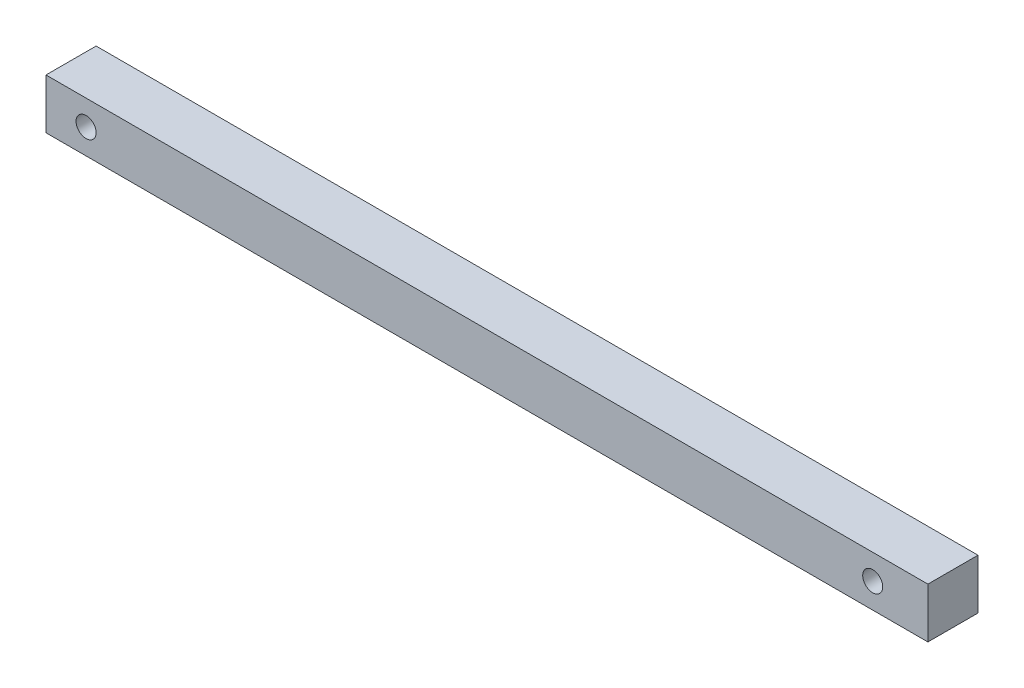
ISO-10303-21;
HEADER;
FILE_DESCRIPTION(('STEP AP214'),'2;1');
FILE_NAME('part.step','',(''),(''),'','','');
FILE_SCHEMA(('AUTOMOTIVE_DESIGN { 1 0 10303 214 1 1 1 1 }'));
ENDSEC;
DATA;
#1=APPLICATION_CONTEXT('core data for automotive mechanical design processes');
#2=APPLICATION_PROTOCOL_DEFINITION('international standard','automotive_design',2000,#1);
#3=PRODUCT_CONTEXT('',#1,'mechanical');
#4=PRODUCT('Part','Part','',(#3));
#5=PRODUCT_RELATED_PRODUCT_CATEGORY('part','',(#4));
#6=PRODUCT_DEFINITION_FORMATION('','',#4);
#7=PRODUCT_DEFINITION_CONTEXT('part definition',#1,'design');
#8=PRODUCT_DEFINITION('design','',#6,#7);
#9=PRODUCT_DEFINITION_SHAPE('','',#8);
#10=(LENGTH_UNIT() NAMED_UNIT(*) SI_UNIT(.MILLI.,.METRE.));
#11=(NAMED_UNIT(*) PLANE_ANGLE_UNIT() SI_UNIT($,.RADIAN.));
#12=(NAMED_UNIT(*) SI_UNIT($,.STERADIAN.) SOLID_ANGLE_UNIT());
#13=UNCERTAINTY_MEASURE_WITH_UNIT(LENGTH_MEASURE(1.E-05),#10,'distance_accuracy_value','');
#14=(GEOMETRIC_REPRESENTATION_CONTEXT(3) GLOBAL_UNCERTAINTY_ASSIGNED_CONTEXT((#13)) GLOBAL_UNIT_ASSIGNED_CONTEXT((#10,
#11,#12)) REPRESENTATION_CONTEXT('',''));
#15=CARTESIAN_POINT('',(0.,0.,0.));
#16=DIRECTION('',(0.,0.,1.));
#17=DIRECTION('',(1.,0.,0.));
#18=AXIS2_PLACEMENT_3D('',#15,#16,#17);
#19=CARTESIAN_POINT('',(-50.,2.5,5.));
#20=DIRECTION('',(1.,0.,0.));
#21=DIRECTION('',(0.,0.,-1.));
#22=AXIS2_PLACEMENT_3D('',#19,#20,#21);
#23=PLANE('',#22);
#24=DIRECTION('',(0.,-1.,0.));
#25=VECTOR('',#24,1.);
#26=CARTESIAN_POINT('',(-50.,2.5,0.));
#27=LINE('',#26,#25);
#28=CARTESIAN_POINT('',(-50.,2.5,0.));
#29=VERTEX_POINT('',#28);
#30=CARTESIAN_POINT('',(-50.,-2.5,0.));
#31=VERTEX_POINT('',#30);
#32=EDGE_CURVE('E96',#29,#31,#27,.T.);
#33=ORIENTED_EDGE('',*,*,#32,.T.);
#34=DIRECTION('',(0.,0.,-1.));
#35=VECTOR('',#34,1.);
#36=CARTESIAN_POINT('',(-50.,-2.5,5.));
#37=LINE('',#36,#35);
#38=CARTESIAN_POINT('',(-50.,-2.5,5.));
#39=VERTEX_POINT('',#38);
#40=EDGE_CURVE('E11',#39,#31,#37,.T.);
#41=ORIENTED_EDGE('',*,*,#40,.F.);
#42=DIRECTION('',(0.,-1.,0.));
#43=VECTOR('',#42,1.);
#44=CARTESIAN_POINT('',(-50.,2.5,5.));
#45=LINE('',#44,#43);
#46=CARTESIAN_POINT('',(-50.,2.5,5.));
#47=VERTEX_POINT('',#46);
#48=EDGE_CURVE('E84',#47,#39,#45,.T.);
#49=ORIENTED_EDGE('',*,*,#48,.F.);
#50=DIRECTION('',(0.,0.,-1.));
#51=VECTOR('',#50,1.);
#52=CARTESIAN_POINT('',(-50.,2.5,5.));
#53=LINE('',#52,#51);
#54=EDGE_CURVE('E92',#47,#29,#53,.T.);
#55=ORIENTED_EDGE('',*,*,#54,.T.);
#56=EDGE_LOOP('',(#33,#41,#49,#55));
#57=FACE_BOUND('',#56,.T.);
#58=ADVANCED_FACE('F33',(#57),#23,.F.);
#59=CARTESIAN_POINT('',(-50.,-2.5,5.));
#60=DIRECTION('',(0.,1.,0.));
#61=DIRECTION('',(0.,0.,1.));
#62=AXIS2_PLACEMENT_3D('',#59,#60,#61);
#63=PLANE('',#62);
#64=DIRECTION('',(1.,0.,0.));
#65=VECTOR('',#64,1.);
#66=CARTESIAN_POINT('',(-50.,-2.5,0.));
#67=LINE('',#66,#65);
#68=CARTESIAN_POINT('',(38.,-2.5,0.));
#69=VERTEX_POINT('',#68);
#70=EDGE_CURVE('E88',#31,#69,#67,.T.);
#71=ORIENTED_EDGE('',*,*,#70,.T.);
#72=DIRECTION('',(0.,0.,-1.));
#73=VECTOR('',#72,1.);
#74=CARTESIAN_POINT('',(38.,-2.5,5.));
#75=LINE('',#74,#73);
#76=CARTESIAN_POINT('',(38.,-2.5,5.));
#77=VERTEX_POINT('',#76);
#78=EDGE_CURVE('E41',#77,#69,#75,.T.);
#79=ORIENTED_EDGE('',*,*,#78,.F.);
#80=DIRECTION('',(1.,0.,0.));
#81=VECTOR('',#80,1.);
#82=CARTESIAN_POINT('',(-50.,-2.5,5.));
#83=LINE('',#82,#81);
#84=EDGE_CURVE('E79',#39,#77,#83,.T.);
#85=ORIENTED_EDGE('',*,*,#84,.F.);
#86=ORIENTED_EDGE('',*,*,#40,.T.);
#87=EDGE_LOOP('',(#71,#79,#85,#86));
#88=FACE_BOUND('',#87,.T.);
#89=ADVANCED_FACE('F87',(#88),#63,.F.);
#90=CARTESIAN_POINT('',(38.,2.5,5.));
#91=DIRECTION('',(-1.,0.,0.));
#92=DIRECTION('',(0.,-1.,0.));
#93=AXIS2_PLACEMENT_3D('',#90,#91,#92);
#94=PLANE('',#93);
#95=DIRECTION('',(0.,1.,0.));
#96=VECTOR('',#95,1.);
#97=CARTESIAN_POINT('',(38.,2.5,0.));
#98=LINE('',#97,#96);
#99=CARTESIAN_POINT('',(38.,2.5,0.));
#100=VERTEX_POINT('',#99);
#101=EDGE_CURVE('E66',#69,#100,#98,.T.);
#102=ORIENTED_EDGE('',*,*,#101,.T.);
#103=DIRECTION('',(0.,0.,-1.));
#104=VECTOR('',#103,1.);
#105=CARTESIAN_POINT('',(38.,2.5,5.));
#106=LINE('',#105,#104);
#107=CARTESIAN_POINT('',(38.,2.5,5.));
#108=VERTEX_POINT('',#107);
#109=EDGE_CURVE('E89',#108,#100,#106,.T.);
#110=ORIENTED_EDGE('',*,*,#109,.F.);
#111=DIRECTION('',(0.,1.,0.));
#112=VECTOR('',#111,1.);
#113=CARTESIAN_POINT('',(38.,2.5,5.));
#114=LINE('',#113,#112);
#115=EDGE_CURVE('E82',#77,#108,#114,.T.);
#116=ORIENTED_EDGE('',*,*,#115,.F.);
#117=ORIENTED_EDGE('',*,*,#78,.T.);
#118=EDGE_LOOP('',(#102,#110,#116,#117));
#119=FACE_BOUND('',#118,.T.);
#120=ADVANCED_FACE('F90',(#119),#94,.F.);
#121=CARTESIAN_POINT('',(-50.,2.5,5.));
#122=DIRECTION('',(0.,-1.,0.));
#123=DIRECTION('',(0.,0.,-1.));
#124=AXIS2_PLACEMENT_3D('',#121,#122,#123);
#125=PLANE('',#124);
#126=DIRECTION('',(-1.,0.,0.));
#127=VECTOR('',#126,1.);
#128=CARTESIAN_POINT('',(-50.,2.5,0.));
#129=LINE('',#128,#127);
#130=EDGE_CURVE('E72',#100,#29,#129,.T.);
#131=ORIENTED_EDGE('',*,*,#130,.T.);
#132=ORIENTED_EDGE('',*,*,#54,.F.);
#133=DIRECTION('',(-1.,0.,0.));
#134=VECTOR('',#133,1.);
#135=CARTESIAN_POINT('',(-50.,2.5,5.));
#136=LINE('',#135,#134);
#137=EDGE_CURVE('E49',#108,#47,#136,.T.);
#138=ORIENTED_EDGE('',*,*,#137,.F.);
#139=ORIENTED_EDGE('',*,*,#109,.T.);
#140=EDGE_LOOP('',(#131,#132,#138,#139));
#141=FACE_BOUND('',#140,.T.);
#142=ADVANCED_FACE('F104',(#141),#125,.F.);
#143=CARTESIAN_POINT('',(0.,0.,5.));
#144=DIRECTION('',(0.,0.,1.));
#145=DIRECTION('',(1.,0.,0.));
#146=AXIS2_PLACEMENT_3D('',#143,#144,#145);
#147=PLANE('',#146);
#148=CARTESIAN_POINT('',(32.494807,0.,5.));
#149=DIRECTION('',(0.,0.,1.));
#150=DIRECTION('',(1.,0.,0.));
#151=AXIS2_PLACEMENT_3D('',#148,#149,#150);
#152=CIRCLE('',#151,0.999999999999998);
#153=CARTESIAN_POINT('',(33.494807,0.,5.));
#154=VERTEX_POINT('',#153);
#155=EDGE_CURVE('E116',#154,#154,#152,.T.);
#156=ORIENTED_EDGE('',*,*,#155,.F.);
#157=EDGE_LOOP('',(#156));
#158=FACE_BOUND('',#157,.T.);
#159=CARTESIAN_POINT('',(-46.,0.,5.));
#160=DIRECTION('',(0.,0.,1.));
#161=DIRECTION('',(1.,0.,0.));
#162=AXIS2_PLACEMENT_3D('',#159,#160,#161);
#163=CIRCLE('',#162,0.999999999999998);
#164=CARTESIAN_POINT('',(-45.,0.,5.));
#165=VERTEX_POINT('',#164);
#166=EDGE_CURVE('E110',#165,#165,#163,.T.);
#167=ORIENTED_EDGE('',*,*,#166,.F.);
#168=EDGE_LOOP('',(#167));
#169=FACE_BOUND('',#168,.T.);
#170=ORIENTED_EDGE('',*,*,#48,.T.);
#171=ORIENTED_EDGE('',*,*,#84,.T.);
#172=ORIENTED_EDGE('',*,*,#115,.T.);
#173=ORIENTED_EDGE('',*,*,#137,.T.);
#174=EDGE_LOOP('',(#170,#171,#172,#173));
#175=FACE_BOUND('',#174,.T.);
#176=ADVANCED_FACE('F80',(#158,#169,#175),#147,.T.);
#177=CARTESIAN_POINT('',(0.,0.,0.));
#178=DIRECTION('',(0.,0.,1.));
#179=DIRECTION('',(1.,0.,0.));
#180=AXIS2_PLACEMENT_3D('',#177,#178,#179);
#181=PLANE('',#180);
#182=CARTESIAN_POINT('',(32.494807,0.,0.));
#183=DIRECTION('',(0.,0.,1.));
#184=DIRECTION('',(1.,0.,0.));
#185=AXIS2_PLACEMENT_3D('',#182,#183,#184);
#186=CIRCLE('',#185,0.999999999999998);
#187=CARTESIAN_POINT('',(33.494807,0.,0.));
#188=VERTEX_POINT('',#187);
#189=EDGE_CURVE('E113',#188,#188,#186,.T.);
#190=ORIENTED_EDGE('',*,*,#189,.T.);
#191=EDGE_LOOP('',(#190));
#192=FACE_BOUND('',#191,.T.);
#193=CARTESIAN_POINT('',(-46.,0.,0.));
#194=DIRECTION('',(0.,0.,1.));
#195=DIRECTION('',(1.,0.,0.));
#196=AXIS2_PLACEMENT_3D('',#193,#194,#195);
#197=CIRCLE('',#196,0.999999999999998);
#198=CARTESIAN_POINT('',(-45.,0.,0.));
#199=VERTEX_POINT('',#198);
#200=EDGE_CURVE('E99',#199,#199,#197,.T.);
#201=ORIENTED_EDGE('',*,*,#200,.T.);
#202=EDGE_LOOP('',(#201));
#203=FACE_BOUND('',#202,.T.);
#204=ORIENTED_EDGE('',*,*,#32,.F.);
#205=ORIENTED_EDGE('',*,*,#130,.F.);
#206=ORIENTED_EDGE('',*,*,#101,.F.);
#207=ORIENTED_EDGE('',*,*,#70,.F.);
#208=EDGE_LOOP('',(#204,#205,#206,#207));
#209=FACE_BOUND('',#208,.T.);
#210=ADVANCED_FACE('F107',(#192,#203,#209),#181,.F.);
#211=CARTESIAN_POINT('',(-46.,0.,0.));
#212=DIRECTION('',(0.,0.,1.));
#213=DIRECTION('',(1.,0.,0.));
#214=AXIS2_PLACEMENT_3D('',#211,#212,#213);
#215=CYLINDRICAL_SURFACE('',#214,0.999999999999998);
#216=ORIENTED_EDGE('',*,*,#200,.F.);
#217=EDGE_LOOP('',(#216));
#218=FACE_BOUND('',#217,.T.);
#219=ORIENTED_EDGE('',*,*,#166,.T.);
#220=EDGE_LOOP('',(#219));
#221=FACE_BOUND('',#220,.T.);
#222=ADVANCED_FACE('F127',(#218,#221),#215,.F.);
#223=CARTESIAN_POINT('',(32.494807,0.,0.));
#224=DIRECTION('',(0.,0.,1.));
#225=DIRECTION('',(1.,0.,0.));
#226=AXIS2_PLACEMENT_3D('',#223,#224,#225);
#227=CYLINDRICAL_SURFACE('',#226,0.999999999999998);
#228=ORIENTED_EDGE('',*,*,#189,.F.);
#229=EDGE_LOOP('',(#228));
#230=FACE_BOUND('',#229,.T.);
#231=ORIENTED_EDGE('',*,*,#155,.T.);
#232=EDGE_LOOP('',(#231));
#233=FACE_BOUND('',#232,.T.);
#234=ADVANCED_FACE('F124',(#230,#233),#227,.F.);
#235=CLOSED_SHELL('',(#58,#89,#120,#142,#176,#210,#222,#234));
#236=MANIFOLD_SOLID_BREP('B2',#235);
#237=ADVANCED_BREP_SHAPE_REPRESENTATION('',(#18,#236),#14);
#238=SHAPE_DEFINITION_REPRESENTATION(#9,#237);
ENDSEC;
END-ISO-10303-21;
